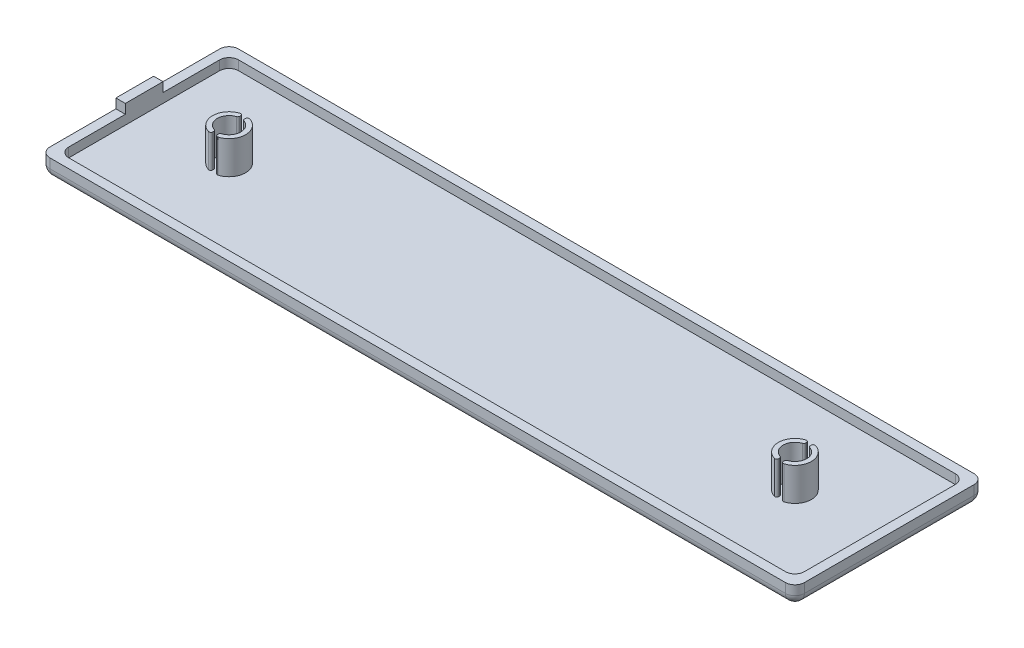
from build123d import *

# Parameters (mm, degrees)
SKETCH_1_W      = 160
SKETCH_1_H      = 40
SKETCH_1_W_2    = 156
SKETCH_1_H_2    = 35.9988184
EXTRUDE_1_DEPTH = 4
SKETCH_1_2_W    = 156
SKETCH_1_2_H    = 35.9988184
EXTRUDE_2_DEPTH = 2
FILLET_1_R      = 2
FILLET_2_R      = 2
EXTRUDE_4_DEPTH = 7
SKETCH_4_W      = 8
SKETCH_4_H      = 2
EXTRUDE_5_DEPTH = 2


with BuildPart() as part:
    # Sketch 1 → Extrude 1 (new body)
    with BuildSketch(Plane(origin=(0, 0, 0), x_dir=(1, 0, 0), z_dir=(0, 1, 0))):
        with Locations((51.448137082, -7.812325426)):
            Rectangle(SKETCH_1_W, SKETCH_1_H)
        with Locations((51.448137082, -7.812916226)):
            Rectangle(SKETCH_1_W_2, SKETCH_1_H_2, mode=Mode.SUBTRACT)
    extrude(amount=EXTRUDE_1_DEPTH)

    # Sketch 1_2 → Extrude 2 (add)
    with BuildSketch(Plane(origin=(0, 0, 0), x_dir=(1, 0, 0), z_dir=(0, 1, 0))):
        with Locations((51.448137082, -7.812916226)):
            Rectangle(SKETCH_1_2_W, SKETCH_1_2_H)
    extrude(amount=EXTRUDE_2_DEPTH)

    # Fillet 1
    fillet_1_edges = [part.edges().sort_by_distance(p)[0] for p in [
        (-26.551862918, 3, -10.186492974),
        (-26.551862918, 3, 25.812325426),
        (129.448137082, 3, 25.812325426),
        (129.448137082, 3, -10.186492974),
        (-28.551862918, 2, -12.187674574),
        (131.448137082, 2, -12.187674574),
        (131.448137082, 2, 27.812325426),
        (-28.551862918, 2, 27.812325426),
    ]]
    fillet(fillet_1_edges, radius=FILLET_1_R)

    # Fillet 2
    fillet_2_edges = [part.edges().sort_by_distance(p)[0] for p in [
        (-28.551862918, 0, 7.812325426),
        (51.448137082, 0, -12.187674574),
        (131.448137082, 0, 7.812325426),
        (51.448137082, 0, 27.812325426),
        (130.862350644, 0, 27.226538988),
        (-27.96607648, 0, 27.226538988),
        (130.862350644, 0, -11.601888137),
        (-27.96607648, 0, -11.601888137),
    ]]
    fillet(fillet_2_edges, radius=FILLET_2_R)

    # Sketch 3 → Extrude 4 (add)
    with BuildSketch(Plane(origin=(0, 2, 0), x_dir=(1, 0, 0), z_dir=(0, 1, 0))):
        with BuildLine():
            Line((-8.051862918, -10.569135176), (-8.051862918, -10.77880482))
            ThreePointArc((-8.051862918, -10.77880482), (-7.890136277, -11.100092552), (-7.535733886, -11.161576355))
            ThreePointArc((-7.535733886, -11.161576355), (-5.051862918, -7.812325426), (-7.535733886, -4.463074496))
            ThreePointArc((-7.535733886, -4.463074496), (-7.890136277, -4.524558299), (-8.051862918, -4.845846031))
            Line((-8.051862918, -4.845846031), (-8.051862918, -5.055515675))
            ThreePointArc((-8.051862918, -5.055515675), (-7.975633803, -5.290403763), (-7.776000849, -5.435765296))
            ThreePointArc((-7.776000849, -5.435765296), (-6.051862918, -7.812325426), (-7.776000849, -10.188885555))
            ThreePointArc((-7.776000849, -10.188885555), (-7.975633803, -10.334247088), (-8.051862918, -10.569135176))
        make_face()
        with BuildLine():
            Line((-9.051862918, -10.569135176), (-9.051862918, -10.77880482))
            ThreePointArc((-9.051862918, -10.77880482), (-9.213589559, -11.100092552), (-9.56799195, -11.161576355))
            ThreePointArc((-9.56799195, -11.161576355), (-12.051862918, -7.812325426), (-9.56799195, -4.463074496))
            ThreePointArc((-9.56799195, -4.463074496), (-9.213589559, -4.524558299), (-9.051862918, -4.845846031))
            Line((-9.051862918, -4.845846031), (-9.051862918, -5.055515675))
            ThreePointArc((-9.051862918, -5.055515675), (-9.128092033, -5.290403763), (-9.327724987, -5.435765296))
            ThreePointArc((-9.327724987, -5.435765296), (-11.051862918, -7.812325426), (-9.327724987, -10.188885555))
            ThreePointArc((-9.327724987, -10.188885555), (-9.128092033, -10.334247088), (-9.051862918, -10.569135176))
        make_face()
        with BuildLine():
            Line((111.948137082, -5.055515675), (111.948137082, -4.845846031))
            ThreePointArc((111.948137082, -4.845846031), (112.109863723, -4.524558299), (112.464266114, -4.463074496))
            ThreePointArc((112.464266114, -4.463074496), (114.948137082, -7.812325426), (112.464266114, -11.161576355))
            ThreePointArc((112.464266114, -11.161576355), (112.109863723, -11.100092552), (111.948137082, -10.77880482))
            Line((111.948137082, -10.77880482), (111.948137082, -10.569135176))
            ThreePointArc((111.948137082, -10.569135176), (112.024366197, -10.334247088), (112.223999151, -10.188885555))
            ThreePointArc((112.223999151, -10.188885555), (113.948137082, -7.812325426), (112.223999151, -5.435765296))
            ThreePointArc((112.223999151, -5.435765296), (112.024366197, -5.290403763), (111.948137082, -5.055515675))
        make_face()
        with BuildLine():
            Line((110.948137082, -5.055515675), (110.948137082, -4.845846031))
            ThreePointArc((110.948137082, -4.845846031), (110.786410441, -4.524558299), (110.43200805, -4.463074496))
            ThreePointArc((110.43200805, -4.463074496), (107.948137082, -7.812325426), (110.43200805, -11.161576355))
            ThreePointArc((110.43200805, -11.161576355), (110.786410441, -11.100092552), (110.948137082, -10.77880482))
            Line((110.948137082, -10.77880482), (110.948137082, -10.569135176))
            ThreePointArc((110.948137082, -10.569135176), (110.871907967, -10.334247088), (110.672275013, -10.188885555))
            ThreePointArc((110.672275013, -10.188885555), (108.948137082, -7.812325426), (110.672275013, -5.435765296))
            ThreePointArc((110.672275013, -5.435765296), (110.871907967, -5.290403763), (110.948137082, -5.055515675))
        make_face()
    extrude(amount=EXTRUDE_4_DEPTH)

    # Sketch 4 → Extrude 5 (add)
    with BuildSketch(Plane.ZY.offset(28.551862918)):
        with Locations((7.812325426, 5)):
            Rectangle(SKETCH_4_W, SKETCH_4_H)
    extrude(amount=-EXTRUDE_5_DEPTH)


solid = part.part
